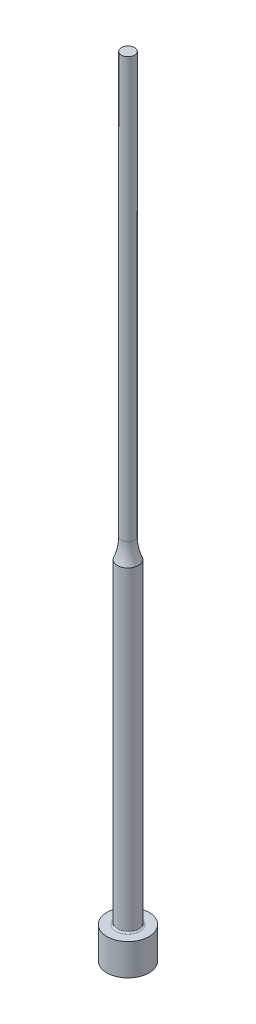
from build123d import *


with BuildPart() as part:
    # Sketch1 → Revolve1 (revolve)
    with BuildSketch(Plane.XY, mode=Mode.PRIVATE) as revolve1_sk:
        with BuildLine():
            Line((0, 0), (4, 0))
            Line((4, 0), (4, 6))
            Line((4, 6), (2.3, 6))
            ThreePointArc((2.3, 6), (2.087867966, 6.087867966), (2, 6.3))
            Line((2, 6.3), (2, 66.200328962))
            ThreePointArc((2, 66.200328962), (1.439291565, 68.063508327), (1.25, 70))
            Line((1.25, 70), (1.25, 150))
            Line((1.25, 150), (0, 150))
            Line((0, 150), (0, 0))
        make_face()
    revolve(revolve1_sk.sketch.rotate(Axis((0, 150, 0), (0, -1, 0)), 180), axis=Axis((0, 150, 0), (0, -1, 0)))


solid = part.part
